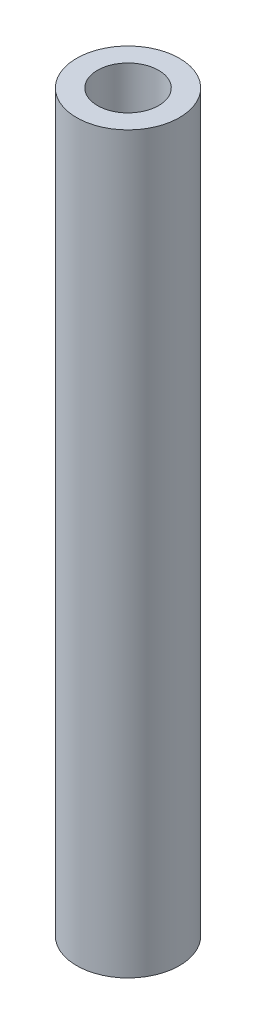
from build123d import *

# Parameters (mm, degrees)
SKETCH1_R           = 10.668
SKETCH1_R_2         = 6.35
BOSS_EXTRUDE1_DEPTH = 152.4


with BuildPart() as part:
    # Sketch1 → Boss-Extrude1 (new body)
    with BuildSketch(Plane(origin=(0, 0, 0), x_dir=(1, 0, 0), z_dir=(0, 1, 0))):
        with Locations(Location((0, 0, 0), (0, 0, 90))):
            Circle(SKETCH1_R)
        with Locations(Location((0, 0, 0), (0, 0, 90))):
            Circle(SKETCH1_R_2, mode=Mode.SUBTRACT)
    extrude(amount=BOSS_EXTRUDE1_DEPTH)


solid = part.part
